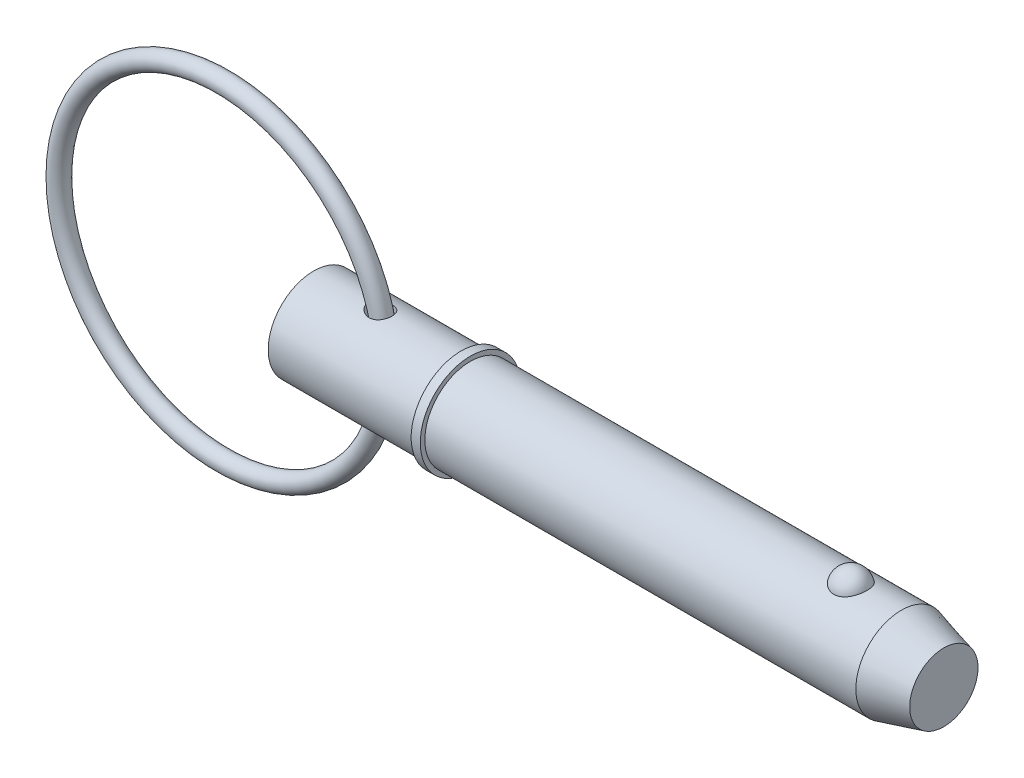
ISO-10303-21;
HEADER;
FILE_DESCRIPTION(('STEP AP214'),'2;1');
FILE_NAME('part.step','',(''),(''),'','','');
FILE_SCHEMA(('AUTOMOTIVE_DESIGN { 1 0 10303 214 1 1 1 1 }'));
ENDSEC;
DATA;
#1=APPLICATION_CONTEXT('core data for automotive mechanical design processes');
#2=APPLICATION_PROTOCOL_DEFINITION('international standard','automotive_design',2000,#1);
#3=PRODUCT_CONTEXT('',#1,'mechanical');
#4=PRODUCT('Part','Part','',(#3));
#5=PRODUCT_RELATED_PRODUCT_CATEGORY('part','',(#4));
#6=PRODUCT_DEFINITION_FORMATION('','',#4);
#7=PRODUCT_DEFINITION_CONTEXT('part definition',#1,'design');
#8=PRODUCT_DEFINITION('design','',#6,#7);
#9=PRODUCT_DEFINITION_SHAPE('','',#8);
#10=(LENGTH_UNIT() NAMED_UNIT(*) SI_UNIT(.MILLI.,.METRE.));
#11=(NAMED_UNIT(*) PLANE_ANGLE_UNIT() SI_UNIT($,.RADIAN.));
#12=(NAMED_UNIT(*) SI_UNIT($,.STERADIAN.) SOLID_ANGLE_UNIT());
#13=UNCERTAINTY_MEASURE_WITH_UNIT(LENGTH_MEASURE(1.E-05),#10,'distance_accuracy_value','');
#14=(GEOMETRIC_REPRESENTATION_CONTEXT(3) GLOBAL_UNCERTAINTY_ASSIGNED_CONTEXT((#13)) GLOBAL_UNIT_ASSIGNED_CONTEXT((#10,
#11,#12)) REPRESENTATION_CONTEXT('',''));
#15=CARTESIAN_POINT('',(0.,0.,0.));
#16=DIRECTION('',(0.,0.,1.));
#17=DIRECTION('',(1.,0.,0.));
#18=AXIS2_PLACEMENT_3D('',#15,#16,#17);
#19=CARTESIAN_POINT('',(-15.855506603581,0.,0.));
#20=DIRECTION('',(0.,0.,1.));
#21=DIRECTION('',(1.,0.,0.));
#22=AXIS2_PLACEMENT_3D('',#19,#20,#21);
#23=TOROIDAL_SURFACE('',#22,28.575,1.588);
#24=CARTESIAN_POINT('',(14.307493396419,0.,0.));
#25=VERTEX_POINT('',#24);
#26=VERTEX_LOOP('',#25);
#27=FACE_BOUND('',#26,.T.);
#28=ADVANCED_FACE('P0_F12',(#27),#23,.T.);
#29=CLOSED_SHELL('',(#28));
#30=MANIFOLD_SOLID_BREP('P0_B1',#29);
#31=CARTESIAN_POINT('',(0.,0.,0.));
#32=DIRECTION('',(1.,0.,0.));
#33=DIRECTION('',(0.,0.,-1.));
#34=AXIS2_PLACEMENT_3D('',#31,#32,#33);
#35=CYLINDRICAL_SURFACE('',#34,7.94);
#36=CARTESIAN_POINT('',(9.9064878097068,7.86092706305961,-1.11777712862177));
#37=CARTESIAN_POINT('',(9.98046148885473,7.84701054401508,-1.21564239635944));
#38=CARTESIAN_POINT('',(10.0632949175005,7.83217804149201,-1.30680329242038));
#39=CARTESIAN_POINT('',(10.243327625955,7.80247884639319,-1.47382688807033));
#40=CARTESIAN_POINT('',(10.3405572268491,7.78761214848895,-1.54965647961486));
#41=CARTESIAN_POINT('',(10.5460150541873,7.75960959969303,-1.6842723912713));
#42=CARTESIAN_POINT('',(10.654212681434,7.74646915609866,-1.74310445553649));
#43=CARTESIAN_POINT('',(10.8789333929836,7.72340979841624,-1.84259563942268));
#44=CARTESIAN_POINT('',(10.9954527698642,7.71348946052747,-1.88326279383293));
#45=CARTESIAN_POINT('',(11.2371543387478,7.69793327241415,-1.94589519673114));
#46=CARTESIAN_POINT('',(11.3624861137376,7.69242163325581,-1.96732022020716));
#47=CARTESIAN_POINT('',(11.6151110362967,7.68708151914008,-1.98809161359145));
#48=CARTESIAN_POINT('',(11.7424035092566,7.68725113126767,-1.98744541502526));
#49=CARTESIAN_POINT('',(11.9871377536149,7.69329740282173,-1.96389977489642));
#50=CARTESIAN_POINT('',(12.1047148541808,7.69883374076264,-1.94232728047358));
#51=CARTESIAN_POINT('',(12.3339179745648,7.7145667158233,-1.87886184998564));
#52=CARTESIAN_POINT('',(12.445546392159,7.72476145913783,-1.83697717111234));
#53=CARTESIAN_POINT('',(12.6521036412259,7.7477815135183,-1.73721211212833));
#54=CARTESIAN_POINT('',(12.7476463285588,7.76039274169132,-1.68054854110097));
#55=CARTESIAN_POINT('',(12.9274536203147,7.7871582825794,-1.55179691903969));
#56=CARTESIAN_POINT('',(13.0117191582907,7.8013124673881,-1.47971014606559));
#57=CARTESIAN_POINT('',(13.16544092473,7.82932755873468,-1.32341211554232));
#58=CARTESIAN_POINT('',(13.2351086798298,7.84318958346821,-1.23940873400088));
#59=CARTESIAN_POINT('',(13.3595610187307,7.86933512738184,-1.06080152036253));
#60=CARTESIAN_POINT('',(13.4143450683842,7.88161858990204,-0.966197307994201));
#61=CARTESIAN_POINT('',(13.5082288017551,7.90340571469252,-0.767990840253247));
#62=CARTESIAN_POINT('',(13.5471601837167,7.91287927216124,-0.664305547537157));
#63=CARTESIAN_POINT('',(13.6076213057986,7.92785679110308,-0.451705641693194));
#64=CARTESIAN_POINT('',(13.6291504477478,7.93336061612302,-0.342790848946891));
#65=CARTESIAN_POINT('',(13.6544025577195,7.93983472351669,-0.12204266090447));
#66=CARTESIAN_POINT('',(13.6580055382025,7.94077445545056,-0.0101946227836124));
#67=CARTESIAN_POINT('',(13.6469977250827,7.93793630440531,0.212542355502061));
#68=CARTESIAN_POINT('',(13.6323866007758,7.93415833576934,0.323431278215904));
#69=CARTESIAN_POINT('',(13.5852649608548,7.92228583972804,0.541194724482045));
#70=CARTESIAN_POINT('',(13.5527398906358,7.91418780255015,0.648065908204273));
#71=CARTESIAN_POINT('',(13.4705326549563,7.8945509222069,0.854658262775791));
#72=CARTESIAN_POINT('',(13.4208502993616,7.88301204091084,0.954379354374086));
#73=CARTESIAN_POINT('',(13.3056021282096,7.85778224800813,1.14366619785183));
#74=CARTESIAN_POINT('',(13.2400609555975,7.8440946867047,1.23324739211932));
#75=CARTESIAN_POINT('',(13.0946981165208,7.8160855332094,1.39984119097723));
#76=CARTESIAN_POINT('',(13.0148777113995,7.80176399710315,1.47685490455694));
#77=CARTESIAN_POINT('',(12.8438529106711,7.774237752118,1.61548556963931));
#78=CARTESIAN_POINT('',(12.7527554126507,7.76102428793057,1.67723263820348));
#79=CARTESIAN_POINT('',(12.5611987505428,7.73705789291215,1.78453696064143));
#80=CARTESIAN_POINT('',(12.4607407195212,7.72630466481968,1.83009617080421));
#81=CARTESIAN_POINT('',(12.2541997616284,7.70849465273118,1.90371822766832));
#82=CARTESIAN_POINT('',(12.1481665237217,7.7014098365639,1.93191408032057));
#83=CARTESIAN_POINT('',(11.9327851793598,7.69148605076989,1.97105353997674));
#84=CARTESIAN_POINT('',(11.8234367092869,7.68864754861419,1.98199524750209));
#85=CARTESIAN_POINT('',(11.6016024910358,7.68735890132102,1.98698770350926));
#86=CARTESIAN_POINT('',(11.4891069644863,7.68902083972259,1.98060702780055));
#87=CARTESIAN_POINT('',(11.2665484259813,7.6966276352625,1.95083303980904));
#88=CARTESIAN_POINT('',(11.1564861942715,7.70257384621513,1.92743434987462));
#89=CARTESIAN_POINT('',(10.9339966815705,7.71853798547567,1.86251478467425));
#90=CARTESIAN_POINT('',(10.8219140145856,7.72880438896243,1.81987394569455));
#91=CARTESIAN_POINT('',(10.6060441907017,7.75216432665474,1.7176403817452));
#92=CARTESIAN_POINT('',(10.5022611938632,7.76525926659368,1.65803922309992));
#93=CARTESIAN_POINT('',(10.3000447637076,7.79362794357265,1.51929354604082));
#94=CARTESIAN_POINT('',(10.2022480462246,7.80898310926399,1.43923272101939));
#95=CARTESIAN_POINT('',(10.0221668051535,7.83939672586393,1.26310118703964));
#96=CARTESIAN_POINT('',(9.93988168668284,7.85445518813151,1.16703109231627));
#97=CARTESIAN_POINT('',(9.79729823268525,7.88178950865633,0.964874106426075));
#98=CARTESIAN_POINT('',(9.73627994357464,7.89414970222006,0.859310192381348));
#99=CARTESIAN_POINT('',(9.63554001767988,7.91508909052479,0.638143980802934));
#100=CARTESIAN_POINT('',(9.59578986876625,7.92367334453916,0.522555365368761));
#101=CARTESIAN_POINT('',(9.54388714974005,7.93499161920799,0.300466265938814));
#102=CARTESIAN_POINT('',(9.52888458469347,7.93832727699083,0.194660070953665));
#103=CARTESIAN_POINT('',(9.51823078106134,7.94068976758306,-0.0179747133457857));
#104=CARTESIAN_POINT('',(9.52257317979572,7.93971801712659,-0.12480295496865));
#105=CARTESIAN_POINT('',(9.54911264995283,7.93386114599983,-0.326814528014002));
#106=CARTESIAN_POINT('',(9.56976509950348,7.92931471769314,-0.422217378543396));
#107=CARTESIAN_POINT('',(9.62591284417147,7.91721462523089,-0.608271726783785));
#108=CARTESIAN_POINT('',(9.66139801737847,7.90966301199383,-0.698926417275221));
#109=CARTESIAN_POINT('',(9.7317197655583,7.89515389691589,-0.844763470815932));
#110=CARTESIAN_POINT('',(9.76292633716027,7.88881879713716,-0.901801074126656));
#111=CARTESIAN_POINT('',(9.83075962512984,7.87538342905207,-1.01244242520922));
#112=CARTESIAN_POINT('',(9.86738597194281,7.86828321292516,-1.06604640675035));
#113=CARTESIAN_POINT('',(9.9064878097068,7.86092706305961,-1.11777712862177));
#114=B_SPLINE_CURVE_WITH_KNOTS('',3,(#36,#37,#38,#39,#40,#41,#42,#43,#44,#45,#46,#47,#48,#49,
#50,#51,#52,#53,#54,#55,#56,#57,#58,#59,#60,#61,#62,#63,#64,#65,#66,#67,#68,#69,#70,#71,#72,#73,
#74,#75,#76,#77,#78,#79,#80,#81,#82,#83,#84,#85,#86,#87,#88,#89,#90,#91,#92,#93,#94,#95,#96,#97,
#98,#99,#100,#101,#102,#103,#104,#105,#106,#107,#108,#109,#110,#111,#112,#113),.UNSPECIFIED.,
.T.,.F.,(4,2,2,2,2,2,2,2,2,2,2,2,2,2,2,2,2,2,2,2,2,2,2,2,2,2,2,2,2,2,2,2,2,2,2,2,2,2,4),(0.,
0.370138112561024,0.741067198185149,1.11098852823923,1.48074607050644,1.86058657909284,
2.24029919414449,2.59740885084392,2.95437345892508,3.2881332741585,3.6218654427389,
3.95036374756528,4.27887384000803,4.61078596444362,4.94270949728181,5.27685177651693,
5.61100012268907,5.94542035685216,6.27984429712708,6.61375187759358,6.94762997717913,
7.27855592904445,7.60944187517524,7.93776058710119,8.26611544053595,8.60272268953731,
8.93943635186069,9.29895306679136,9.65864886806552,10.0387340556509,10.4188046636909,
10.7843533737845,11.1494107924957,11.4683925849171,11.7872694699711,12.0791172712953,
12.3707662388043,12.5664313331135,12.7620830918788),.UNSPECIFIED.);
#115=CARTESIAN_POINT('',(9.9064878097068,7.86092706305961,-1.11777712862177));
#116=VERTEX_POINT('',#115);
#117=EDGE_CURVE('P1_E42',#116,#116,#114,.T.);
#118=ORIENTED_EDGE('',*,*,#117,.T.);
#119=EDGE_LOOP('',(#118));
#120=FACE_BOUND('',#119,.T.);
#121=CARTESIAN_POINT('',(0.,0.,0.));
#122=DIRECTION('',(1.,0.,0.));
#123=DIRECTION('',(0.,0.,-1.));
#124=AXIS2_PLACEMENT_3D('',#121,#122,#123);
#125=CIRCLE('',#124,7.94);
#126=CARTESIAN_POINT('',(0.,0.,-7.94));
#127=VERTEX_POINT('',#126);
#128=EDGE_CURVE('P1_E9',#127,#127,#125,.T.);
#129=ORIENTED_EDGE('',*,*,#128,.T.);
#130=EDGE_LOOP('',(#129));
#131=FACE_BOUND('',#130,.T.);
#132=CARTESIAN_POINT('',(25.722,0.,0.));
#133=DIRECTION('',(1.,0.,0.));
#134=DIRECTION('',(0.,0.,-1.));
#135=AXIS2_PLACEMENT_3D('',#132,#133,#134);
#136=CIRCLE('',#135,7.94);
#137=CARTESIAN_POINT('',(25.722,0.,-7.94));
#138=VERTEX_POINT('',#137);
#139=EDGE_CURVE('P1_E25',#138,#138,#136,.T.);
#140=ORIENTED_EDGE('',*,*,#139,.F.);
#141=EDGE_LOOP('',(#140));
#142=FACE_BOUND('',#141,.T.);
#143=CARTESIAN_POINT('',(9.9064878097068,-7.86092706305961,-1.11777712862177));
#144=CARTESIAN_POINT('',(9.84378768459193,-7.87272256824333,-1.03482250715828));
#145=CARTESIAN_POINT('',(9.7874122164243,-7.88386682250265,-0.947002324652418));
#146=CARTESIAN_POINT('',(9.68947008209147,-7.90377389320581,-0.763202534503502));
#147=CARTESIAN_POINT('',(9.64789384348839,-7.91253824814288,-0.667228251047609));
#148=CARTESIAN_POINT('',(9.58141396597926,-7.92676779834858,-0.468898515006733));
#149=CARTESIAN_POINT('',(9.55658638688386,-7.93221793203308,-0.366516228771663));
#150=CARTESIAN_POINT('',(9.525398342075,-7.9390896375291,-0.158837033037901));
#151=CARTESIAN_POINT('',(9.51903196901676,-7.94051249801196,-0.0535410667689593));
#152=CARTESIAN_POINT('',(9.5249639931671,-7.93919670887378,0.149856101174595));
#153=CARTESIAN_POINT('',(9.53611757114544,-7.9367132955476,0.247994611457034));
#154=CARTESIAN_POINT('',(9.57435037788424,-7.92833496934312,0.440949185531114));
#155=CARTESIAN_POINT('',(9.60143086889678,-7.92243978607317,0.535764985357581));
#156=CARTESIAN_POINT('',(9.67027872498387,-7.90782830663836,0.720026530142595));
#157=CARTESIAN_POINT('',(9.71210005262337,-7.89910165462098,0.809451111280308));
#158=CARTESIAN_POINT('',(9.80864905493,-7.87966534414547,0.980775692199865));
#159=CARTESIAN_POINT('',(9.86338092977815,-7.86895504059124,1.06267323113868));
#160=CARTESIAN_POINT('',(9.99009906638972,-7.84531573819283,1.22559225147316));
#161=CARTESIAN_POINT('',(10.0632770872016,-7.8322718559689,1.30566871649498));
#162=CARTESIAN_POINT('',(10.2208237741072,-7.80611237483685,1.45392159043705));
#163=CARTESIAN_POINT('',(10.3051986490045,-7.79299674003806,1.52209134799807));
#164=CARTESIAN_POINT('',(10.4935539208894,-7.76638841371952,1.65280871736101));
#165=CARTESIAN_POINT('',(10.5986730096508,-7.75303312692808,1.71374951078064));
#166=CARTESIAN_POINT('',(10.8175805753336,-7.72920597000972,1.81820073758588));
#167=CARTESIAN_POINT('',(10.9313721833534,-7.71873514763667,1.86170483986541));
#168=CARTESIAN_POINT('',(11.1696833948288,-7.70161777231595,1.93133079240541));
#169=CARTESIAN_POINT('',(11.2944525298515,-7.69514907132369,1.95665138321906));
#170=CARTESIAN_POINT('',(11.5466607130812,-7.6877908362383,1.98537345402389));
#171=CARTESIAN_POINT('',(11.6740986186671,-7.68689896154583,1.98878412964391));
#172=CARTESIAN_POINT('',(11.9206005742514,-7.690938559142,1.97309854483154));
#173=CARTESIAN_POINT('',(12.0397453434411,-7.69555832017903,1.95520713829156));
#174=CARTESIAN_POINT('',(12.2727177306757,-7.70968728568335,1.89872693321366));
#175=CARTESIAN_POINT('',(12.3865475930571,-7.71919440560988,1.86014695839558));
#176=CARTESIAN_POINT('',(12.5975118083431,-7.74115679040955,1.76641559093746));
#177=CARTESIAN_POINT('',(12.6952552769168,-7.75336701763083,1.71257254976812));
#178=CARTESIAN_POINT('',(12.8798510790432,-7.77962828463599,1.58901145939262));
#179=CARTESIAN_POINT('',(12.9667044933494,-7.79367914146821,1.51929498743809));
#180=CARTESIAN_POINT('',(13.1254818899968,-7.82172079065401,1.36751778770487));
#181=CARTESIAN_POINT('',(13.1976693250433,-7.83570718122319,1.28573131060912));
#182=CARTESIAN_POINT('',(13.3274495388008,-7.86236718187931,1.11111271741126));
#183=CARTESIAN_POINT('',(13.3850418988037,-7.87504075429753,1.01828028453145));
#184=CARTESIAN_POINT('',(13.4847470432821,-7.89782512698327,0.823214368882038));
#185=CARTESIAN_POINT('',(13.5267056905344,-7.90791011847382,0.720899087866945));
#186=CARTESIAN_POINT('',(13.5933891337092,-7.92427335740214,0.510509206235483));
#187=CARTESIAN_POINT('',(13.6181132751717,-7.9305514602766,0.402434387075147));
#188=CARTESIAN_POINT('',(13.6498843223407,-7.93866355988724,0.182728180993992));
#189=CARTESIAN_POINT('',(13.6567982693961,-7.94046412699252,0.07107630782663));
#190=CARTESIAN_POINT('',(13.6524060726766,-7.93933046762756,-0.151845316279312));
#191=CARTESIAN_POINT('',(13.6410996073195,-7.93639615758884,-0.26311506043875));
#192=CARTESIAN_POINT('',(13.6005023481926,-7.92610202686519,-0.482238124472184));
#193=CARTESIAN_POINT('',(13.571192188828,-7.91873744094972,-0.590087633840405));
#194=CARTESIAN_POINT('',(13.495246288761,-7.90037565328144,-0.799178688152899));
#195=CARTESIAN_POINT('',(13.4486102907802,-7.88937839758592,-0.900420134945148));
#196=CARTESIAN_POINT('',(13.3391817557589,-7.86497175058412,-1.09328280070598));
#197=CARTESIAN_POINT('',(13.2764083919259,-7.85156522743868,-1.18491525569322));
#198=CARTESIAN_POINT('',(13.1362355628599,-7.8238261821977,-1.35604994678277));
#199=CARTESIAN_POINT('',(13.0588372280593,-7.80949373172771,-1.43555311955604));
#200=CARTESIAN_POINT('',(12.8921392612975,-7.78164292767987,-1.57955181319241));
#201=CARTESIAN_POINT('',(12.8029410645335,-7.76811892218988,-1.64416363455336));
#202=CARTESIAN_POINT('',(12.6146622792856,-7.74328422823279,-1.75742016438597));
#203=CARTESIAN_POINT('',(12.5155829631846,-7.73197325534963,-1.80606692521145));
#204=CARTESIAN_POINT('',(12.31135301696,-7.71289290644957,-1.88588502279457));
#205=CARTESIAN_POINT('',(12.2062651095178,-7.70509254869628,-1.91720981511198));
#206=CARTESIAN_POINT('',(11.9922253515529,-7.69365188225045,-1.96261878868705));
#207=CARTESIAN_POINT('',(11.8832731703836,-7.69001193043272,-1.97670149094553));
#208=CARTESIAN_POINT('',(11.662174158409,-7.6871142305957,-1.98794112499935));
#209=CARTESIAN_POINT('',(11.5500082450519,-7.6879499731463,-1.98473694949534));
#210=CARTESIAN_POINT('',(11.3276038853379,-7.69396349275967,-1.96129119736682));
#211=CARTESIAN_POINT('',(11.2173659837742,-7.6991424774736,-1.94104488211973));
#212=CARTESIAN_POINT('',(10.9943151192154,-7.71363470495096,-1.8826578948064));
#213=CARTESIAN_POINT('',(10.8818004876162,-7.72319478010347,-1.8434396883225));
#214=CARTESIAN_POINT('',(10.6644693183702,-7.74534199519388,-1.74804607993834));
#215=CARTESIAN_POINT('',(10.5596578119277,-7.75793109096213,-1.69185971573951));
#216=CARTESIAN_POINT('',(10.3538333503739,-7.78563853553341,-1.5595801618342));
#217=CARTESIAN_POINT('',(10.2535123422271,-7.80086820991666,-1.48242881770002));
#218=CARTESIAN_POINT('',(10.0678634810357,-7.83136022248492,-1.31182139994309));
#219=CARTESIAN_POINT('',(9.98252491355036,-7.84662252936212,-1.21837707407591));
#220=CARTESIAN_POINT('',(9.9064878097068,-7.86092706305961,-1.11777712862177));
#221=B_SPLINE_CURVE_WITH_KNOTS('',3,(#143,#144,#145,#146,#147,#148,#149,#150,#151,#152,#153,
#154,#155,#156,#157,#158,#159,#160,#161,#162,#163,#164,#165,#166,#167,#168,#169,#170,#171,#172,
#173,#174,#175,#176,#177,#178,#179,#180,#181,#182,#183,#184,#185,#186,#187,#188,#189,#190,#191,
#192,#193,#194,#195,#196,#197,#198,#199,#200,#201,#202,#203,#204,#205,#206,#207,#208,#209,#210,
#211,#212,#213,#214,#215,#216,#217,#218,#219,#220),.UNSPECIFIED.,.T.,.F.,(4,2,2,2,2,2,2,2,2,2,2,
2,2,2,2,2,2,2,2,2,2,2,2,2,2,2,2,2,2,2,2,2,2,2,2,2,2,2,4),(0.,0.313593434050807,
0.626983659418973,0.941787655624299,1.25649090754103,1.55146990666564,1.84647228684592,
2.14256601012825,2.4387561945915,2.76521830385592,3.09186220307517,3.45696288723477,
3.82219601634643,4.20267276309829,4.58298981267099,4.94277962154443,5.30241610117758,
5.63754619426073,5.97264300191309,6.301049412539,6.62946524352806,6.96103833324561,
7.29262401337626,7.62667800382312,7.96073789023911,8.29515773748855,8.6295825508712,
8.96361184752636,9.29761533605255,9.62891449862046,9.96017105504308,10.288443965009,
10.616745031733,10.951930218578,11.2872086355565,11.6442788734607,12.0015802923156,
12.3821516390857,12.762449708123),.UNSPECIFIED.);
#222=CARTESIAN_POINT('',(9.9064878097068,-7.86092706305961,-1.11777712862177));
#223=VERTEX_POINT('',#222);
#224=EDGE_CURVE('P1_E17',#223,#223,#221,.T.);
#225=ORIENTED_EDGE('',*,*,#224,.T.);
#226=EDGE_LOOP('',(#225));
#227=FACE_BOUND('',#226,.T.);
#228=ADVANCED_FACE('P1_F13',(#120,#131,#142,#227),#35,.T.);
#229=CARTESIAN_POINT('',(0.,0.,0.));
#230=DIRECTION('',(1.,0.,0.));
#231=DIRECTION('',(0.,0.,-1.));
#232=AXIS2_PLACEMENT_3D('',#229,#230,#231);
#233=CYLINDRICAL_SURFACE('',#232,7.94);
#234=CARTESIAN_POINT('',(102.451879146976,0.,0.));
#235=DIRECTION('',(1.,0.,0.));
#236=DIRECTION('',(0.,0.,-1.));
#237=AXIS2_PLACEMENT_3D('',#234,#235,#236);
#238=CIRCLE('',#237,7.94);
#239=CARTESIAN_POINT('',(102.451879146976,0.,-7.94));
#240=VERTEX_POINT('',#239);
#241=EDGE_CURVE('P1_E99',#240,#240,#238,.T.);
#242=ORIENTED_EDGE('',*,*,#241,.F.);
#243=EDGE_LOOP('',(#242));
#244=FACE_BOUND('',#243,.T.);
#245=CARTESIAN_POINT('',(27.31,0.,0.));
#246=DIRECTION('',(1.,0.,0.));
#247=DIRECTION('',(0.,0.,-1.));
#248=AXIS2_PLACEMENT_3D('',#245,#246,#247);
#249=CIRCLE('',#248,7.94);
#250=CARTESIAN_POINT('',(27.31,0.,-7.94));
#251=VERTEX_POINT('',#250);
#252=EDGE_CURVE('P1_E96',#251,#251,#249,.T.);
#253=ORIENTED_EDGE('',*,*,#252,.T.);
#254=EDGE_LOOP('',(#253));
#255=FACE_BOUND('',#254,.T.);
#256=CARTESIAN_POINT('',(93.6449074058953,7.37767842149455,2.93486986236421));
#257=CARTESIAN_POINT('',(93.4927496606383,7.3776732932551,2.93487505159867));
#258=CARTESIAN_POINT('',(93.3406329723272,7.38258419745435,2.92262454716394));
#259=CARTESIAN_POINT('',(93.0409284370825,7.40163229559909,2.87404196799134));
#260=CARTESIAN_POINT('',(92.8933394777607,7.41576720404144,2.83771585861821));
#261=CARTESIAN_POINT('',(92.6070187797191,7.4516157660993,2.74218769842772));
#262=CARTESIAN_POINT('',(92.4682745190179,7.47331841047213,2.68301886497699));
#263=CARTESIAN_POINT('',(92.2028822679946,7.52194082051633,2.5435096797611));
#264=CARTESIAN_POINT('',(92.0762366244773,7.5488615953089,2.46316523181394));
#265=CARTESIAN_POINT('',(91.8345349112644,7.60594671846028,2.28090375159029));
#266=CARTESIAN_POINT('',(91.7199065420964,7.63618114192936,2.17844211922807));
#267=CARTESIAN_POINT('',(91.5088787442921,7.69614046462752,1.95608495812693));
#268=CARTESIAN_POINT('',(91.4124826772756,7.72586526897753,1.83618622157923));
#269=CARTESIAN_POINT('',(91.2359381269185,7.78314821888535,1.57628086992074));
#270=CARTESIAN_POINT('',(91.1567072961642,7.81055035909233,1.43561546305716));
#271=CARTESIAN_POINT('',(91.0217979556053,7.85879631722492,1.14236334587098));
#272=CARTESIAN_POINT('',(90.9661216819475,7.87963951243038,0.989775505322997));
#273=CARTESIAN_POINT('',(90.8788121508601,7.91289645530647,0.674619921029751));
#274=CARTESIAN_POINT('',(90.8475309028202,7.925186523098,0.511941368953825));
#275=CARTESIAN_POINT('',(90.810975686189,7.93958930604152,0.183247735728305));
#276=CARTESIAN_POINT('',(90.8057012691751,7.94170219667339,0.0172327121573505));
#277=CARTESIAN_POINT('',(90.8212311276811,7.93554931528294,-0.312672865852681));
#278=CARTESIAN_POINT('',(90.8419253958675,7.92732732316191,-0.476569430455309));
#279=CARTESIAN_POINT('',(90.9087865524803,7.90141534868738,-0.798305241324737));
#280=CARTESIAN_POINT('',(90.9549539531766,7.88372517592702,-0.956144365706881));
#281=CARTESIAN_POINT('',(91.0718986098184,7.84066230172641,-1.26152073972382));
#282=CARTESIAN_POINT('',(91.1427046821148,7.81528060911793,-1.40904568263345));
#283=CARTESIAN_POINT('',(91.3074789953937,7.7594867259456,-1.68950598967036));
#284=CARTESIAN_POINT('',(91.4014488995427,7.72907417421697,-1.82244030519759));
#285=CARTESIAN_POINT('',(91.6108391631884,7.66640424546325,-2.07032792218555));
#286=CARTESIAN_POINT('',(91.7263152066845,7.63414223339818,-2.1852330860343));
#287=CARTESIAN_POINT('',(91.9759006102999,7.57149681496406,-2.39329737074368));
#288=CARTESIAN_POINT('',(92.1100080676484,7.54111321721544,-2.48645870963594));
#289=CARTESIAN_POINT('',(92.3901113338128,7.48650742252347,-2.64628132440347));
#290=CARTESIAN_POINT('',(92.5357605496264,7.46215900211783,-2.71350554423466));
#291=CARTESIAN_POINT('',(92.8374259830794,7.42171253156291,-2.82226614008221));
#292=CARTESIAN_POINT('',(92.9934383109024,7.40561140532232,-2.86381209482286));
#293=CARTESIAN_POINT('',(93.3029708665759,7.38426796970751,-2.91839077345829));
#294=CARTESIAN_POINT('',(93.4562229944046,7.37852109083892,-2.93275024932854));
#295=CARTESIAN_POINT('',(93.7630705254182,7.37700973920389,-2.9365520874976));
#296=CARTESIAN_POINT('',(93.9166658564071,7.38124333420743,-2.92599927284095));
#297=CARTESIAN_POINT('',(94.2149907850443,7.39890635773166,-2.88102897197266));
#298=CARTESIAN_POINT('',(94.3598480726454,7.41205491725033,-2.84733999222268));
#299=CARTESIAN_POINT('',(94.6416432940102,7.44580110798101,-2.75788206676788));
#300=CARTESIAN_POINT('',(94.7785805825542,7.46639934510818,-2.70211132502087));
#301=CARTESIAN_POINT('',(95.0440619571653,7.51339098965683,-2.56858908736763));
#302=CARTESIAN_POINT('',(95.1723548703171,7.53990200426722,-2.49038067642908));
#303=CARTESIAN_POINT('',(95.4142440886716,7.59569503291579,-2.31462737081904));
#304=CARTESIAN_POINT('',(95.5278370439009,7.62497767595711,-2.21707808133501));
#305=CARTESIAN_POINT('',(95.74322156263,7.68489473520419,-1.99982049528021));
#306=CARTESIAN_POINT('',(95.8441488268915,7.71552419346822,-1.87925337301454));
#307=CARTESIAN_POINT('',(96.0251866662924,7.77353016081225,-1.62268826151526));
#308=CARTESIAN_POINT('',(96.1052934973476,7.80090608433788,-1.48668750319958));
#309=CARTESIAN_POINT('',(96.2453615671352,7.85047992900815,-1.19818413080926));
#310=CARTESIAN_POINT('',(96.3045877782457,7.8724818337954,-1.04529016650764));
#311=CARTESIAN_POINT('',(96.3979821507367,7.90785114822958,-0.731080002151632));
#312=CARTESIAN_POINT('',(96.4321497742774,7.92121837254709,-0.569763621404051));
#313=CARTESIAN_POINT('',(96.474795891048,7.93797834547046,-0.242812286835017));
#314=CARTESIAN_POINT('',(96.4832047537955,7.94134405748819,-0.0771668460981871));
#315=CARTESIAN_POINT('',(96.4739626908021,7.93767937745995,0.253276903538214));
#316=CARTESIAN_POINT('',(96.4563120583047,7.93064910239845,0.418075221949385));
#317=CARTESIAN_POINT('',(96.3954247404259,7.90695571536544,0.741525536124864));
#318=CARTESIAN_POINT('',(96.3522819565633,7.8903279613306,0.90019782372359));
#319=CARTESIAN_POINT('',(96.2413535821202,7.84916386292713,1.20759654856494));
#320=CARTESIAN_POINT('',(96.1735665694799,7.82462706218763,1.35632241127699));
#321=CARTESIAN_POINT('',(96.0143718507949,7.7700669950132,1.64032869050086));
#322=CARTESIAN_POINT('',(95.9228616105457,7.7400200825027,1.77554712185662));
#323=CARTESIAN_POINT('',(95.7182960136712,7.67774175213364,2.02800648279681));
#324=CARTESIAN_POINT('',(95.6052410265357,7.64551037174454,2.14524772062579));
#325=CARTESIAN_POINT('',(95.3608318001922,7.58265895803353,2.35778002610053));
#326=CARTESIAN_POINT('',(95.2295833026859,7.5520309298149,2.45319004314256));
#327=CARTESIAN_POINT('',(94.951601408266,7.49579792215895,2.61999897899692));
#328=CARTESIAN_POINT('',(94.8048670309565,7.4701932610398,2.69139637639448));
#329=CARTESIAN_POINT('',(94.4929477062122,7.42622216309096,2.81053241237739));
#330=CARTESIAN_POINT('',(94.3272209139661,7.40825002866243,2.85700910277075));
#331=CARTESIAN_POINT('',(93.9892792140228,7.38398348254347,2.91916850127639));
#332=CARTESIAN_POINT('',(93.8170670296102,7.37768422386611,2.93486399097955));
#333=CARTESIAN_POINT('',(93.6449074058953,7.37767842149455,2.93486986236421));
#334=B_SPLINE_CURVE_WITH_KNOTS('',3,(#256,#257,#258,#259,#260,#261,#262,#263,#264,#265,#266,
#267,#268,#269,#270,#271,#272,#273,#274,#275,#276,#277,#278,#279,#280,#281,#282,#283,#284,#285,
#286,#287,#288,#289,#290,#291,#292,#293,#294,#295,#296,#297,#298,#299,#300,#301,#302,#303,#304,
#305,#306,#307,#308,#309,#310,#311,#312,#313,#314,#315,#316,#317,#318,#319,#320,#321,#322,#323,
#324,#325,#326,#327,#328,#329,#330,#331,#332,#333),.UNSPECIFIED.,.T.,.F.,(4,2,2,2,2,2,2,2,2,2,2,
2,2,2,2,2,2,2,2,2,2,2,2,2,2,2,2,2,2,2,2,2,2,2,2,2,2,2,4),(0.,0.455841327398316,
0.911569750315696,1.36663794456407,1.8217942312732,2.28978983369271,2.75787163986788,
3.24685368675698,3.73588214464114,4.23184282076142,4.72779494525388,5.22165321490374,
5.71552141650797,6.20996917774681,6.70445245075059,7.20023431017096,7.69596557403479,
8.18023418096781,8.66432203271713,9.12410697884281,9.58380291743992,10.0296503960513,
10.4755341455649,10.9312349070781,11.3870393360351,11.8654416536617,12.343929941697,
12.837887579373,13.3318558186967,13.8271581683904,14.3224549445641,14.8159385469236,
15.309450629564,15.8051323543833,16.3008055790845,16.7937101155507,17.2866458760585,
17.8026240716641,18.3183879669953),.UNSPECIFIED.);
#335=CARTESIAN_POINT('',(93.6449074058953,7.37767842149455,2.93486986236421));
#336=VERTEX_POINT('',#335);
#337=EDGE_CURVE('P1_E34',#336,#336,#334,.T.);
#338=ORIENTED_EDGE('',*,*,#337,.T.);
#339=EDGE_LOOP('',(#338));
#340=FACE_BOUND('',#339,.T.);
#341=ADVANCED_FACE('P1_F46',(#244,#255,#340),#233,.T.);
#342=CARTESIAN_POINT('',(0.,0.,0.));
#343=DIRECTION('',(-1.,0.,0.));
#344=DIRECTION('',(0.,0.,1.));
#345=AXIS2_PLACEMENT_3D('',#342,#343,#344);
#346=PLANE('',#345);
#347=ORIENTED_EDGE('',*,*,#128,.F.);
#348=EDGE_LOOP('',(#347));
#349=FACE_BOUND('',#348,.T.);
#350=ADVANCED_FACE('P1_F15',(#349),#346,.T.);
#351=CARTESIAN_POINT('',(25.722,7.94,0.));
#352=DIRECTION('',(-1.,0.,0.));
#353=DIRECTION('',(0.,0.,1.));
#354=AXIS2_PLACEMENT_3D('',#351,#352,#353);
#355=PLANE('',#354);
#356=ORIENTED_EDGE('',*,*,#139,.T.);
#357=EDGE_LOOP('',(#356));
#358=FACE_BOUND('',#357,.T.);
#359=CARTESIAN_POINT('',(25.722,0.,0.));
#360=DIRECTION('',(1.,0.,0.));
#361=DIRECTION('',(0.,0.,-1.));
#362=AXIS2_PLACEMENT_3D('',#359,#360,#361);
#363=CIRCLE('',#362,8.734);
#364=CARTESIAN_POINT('',(25.722,0.,-8.734));
#365=VERTEX_POINT('',#364);
#366=EDGE_CURVE('P1_E30',#365,#365,#363,.T.);
#367=ORIENTED_EDGE('',*,*,#366,.F.);
#368=EDGE_LOOP('',(#367));
#369=FACE_BOUND('',#368,.T.);
#370=ADVANCED_FACE('P1_F81',(#358,#369),#355,.T.);
#371=CARTESIAN_POINT('',(0.,0.,0.));
#372=DIRECTION('',(1.,0.,0.));
#373=DIRECTION('',(0.,0.,-1.));
#374=AXIS2_PLACEMENT_3D('',#371,#372,#373);
#375=CYLINDRICAL_SURFACE('',#374,8.734);
#376=ORIENTED_EDGE('',*,*,#366,.T.);
#377=EDGE_LOOP('',(#376));
#378=FACE_BOUND('',#377,.T.);
#379=CARTESIAN_POINT('',(27.31,0.,0.));
#380=DIRECTION('',(1.,0.,0.));
#381=DIRECTION('',(0.,0.,-1.));
#382=AXIS2_PLACEMENT_3D('',#379,#380,#381);
#383=CIRCLE('',#382,8.734);
#384=CARTESIAN_POINT('',(27.31,0.,-8.734));
#385=VERTEX_POINT('',#384);
#386=EDGE_CURVE('P1_E95',#385,#385,#383,.T.);
#387=ORIENTED_EDGE('',*,*,#386,.F.);
#388=EDGE_LOOP('',(#387));
#389=FACE_BOUND('',#388,.T.);
#390=ADVANCED_FACE('P1_F68',(#378,#389),#375,.T.);
#391=CARTESIAN_POINT('',(27.31,8.734,0.));
#392=DIRECTION('',(1.,0.,0.));
#393=DIRECTION('',(0.,0.,-1.));
#394=AXIS2_PLACEMENT_3D('',#391,#392,#393);
#395=PLANE('',#394);
#396=ORIENTED_EDGE('',*,*,#386,.T.);
#397=EDGE_LOOP('',(#396));
#398=FACE_BOUND('',#397,.T.);
#399=ORIENTED_EDGE('',*,*,#252,.F.);
#400=EDGE_LOOP('',(#399));
#401=FACE_BOUND('',#400,.T.);
#402=ADVANCED_FACE('P1_F62',(#398,#401),#395,.T.);
#403=CARTESIAN_POINT('',(109.86,0.,0.));
#404=DIRECTION('',(-1.,0.,0.));
#405=DIRECTION('',(0.,0.,1.));
#406=AXIS2_PLACEMENT_3D('',#403,#404,#405);
#407=CONICAL_SURFACE('',#406,5.95500000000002,0.26179938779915);
#408=ORIENTED_EDGE('',*,*,#241,.T.);
#409=EDGE_LOOP('',(#408));
#410=FACE_BOUND('',#409,.T.);
#411=CARTESIAN_POINT('',(109.86,0.,0.));
#412=DIRECTION('',(1.,0.,0.));
#413=DIRECTION('',(0.,0.,-1.));
#414=AXIS2_PLACEMENT_3D('',#411,#412,#413);
#415=CIRCLE('',#414,5.95500000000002);
#416=CARTESIAN_POINT('',(109.86,0.,-5.95500000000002));
#417=VERTEX_POINT('',#416);
#418=EDGE_CURVE('P1_E41',#417,#417,#415,.T.);
#419=ORIENTED_EDGE('',*,*,#418,.F.);
#420=EDGE_LOOP('',(#419));
#421=FACE_BOUND('',#420,.T.);
#422=ADVANCED_FACE('P1_F59',(#410,#421),#407,.T.);
#423=CARTESIAN_POINT('',(109.86,5.95500000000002,0.));
#424=DIRECTION('',(1.,0.,0.));
#425=DIRECTION('',(0.,0.,-1.));
#426=AXIS2_PLACEMENT_3D('',#423,#424,#425);
#427=PLANE('',#426);
#428=ORIENTED_EDGE('',*,*,#418,.T.);
#429=EDGE_LOOP('',(#428));
#430=FACE_BOUND('',#429,.T.);
#431=ADVANCED_FACE('P1_F55',(#430),#427,.T.);
#432=CARTESIAN_POINT('',(93.6449074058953,7.146,0.));
#433=DIRECTION('',(-1.,0.,0.));
#434=DIRECTION('',(0.,1.,0.));
#435=AXIS2_PLACEMENT_3D('',#432,#433,#434);
#436=SPHERICAL_SURFACE('',#435,2.94399999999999);
#437=ORIENTED_EDGE('',*,*,#337,.F.);
#438=EDGE_LOOP('',(#437));
#439=FACE_BOUND('',#438,.T.);
#440=ADVANCED_FACE('P1_F50',(#439),#436,.T.);
#441=CARTESIAN_POINT('',(-15.855506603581,0.,0.));
#442=DIRECTION('',(0.,0.,1.));
#443=DIRECTION('',(1.,0.,0.));
#444=AXIS2_PLACEMENT_3D('',#441,#442,#443);
#445=TOROIDAL_SURFACE('',#444,28.575,1.985);
#446=ORIENTED_EDGE('',*,*,#224,.F.);
#447=EDGE_LOOP('',(#446));
#448=FACE_BOUND('',#447,.T.);
#449=ORIENTED_EDGE('',*,*,#117,.F.);
#450=EDGE_LOOP('',(#449));
#451=FACE_BOUND('',#450,.T.);
#452=ADVANCED_FACE('P1_F54',(#448,#451),#445,.F.);
#453=CLOSED_SHELL('',(#228,#341,#350,#370,#390,#402,#422,#431,#440,#452));
#454=MANIFOLD_SOLID_BREP('P1_B1',#453);
#455=ADVANCED_BREP_SHAPE_REPRESENTATION('',(#18,#30,#454),#14);
#456=SHAPE_DEFINITION_REPRESENTATION(#9,#455);
ENDSEC;
END-ISO-10303-21;
